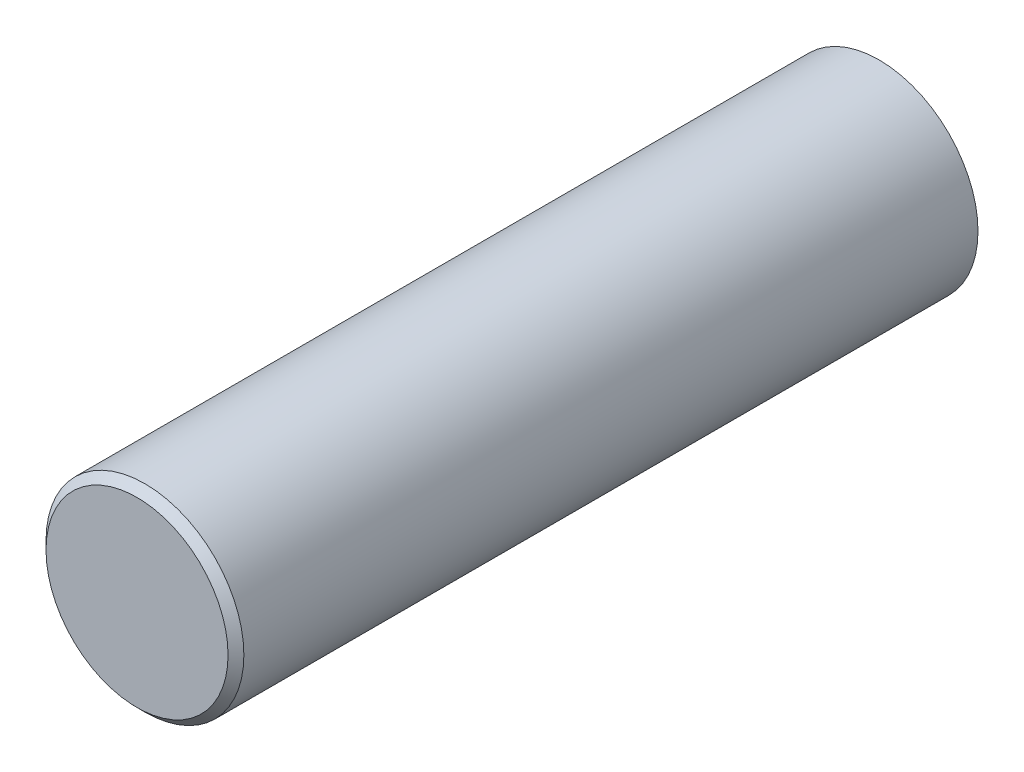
from build123d import *

# Parameters (mm, degrees)
ESQUISSE1_R      = 10
EXTRUSION1_DEPTH = 75
CHANFREIN1_SIZE  = 0.8


with BuildPart() as part:
    # Esquisse1 → Extrusion1 (new body)
    with BuildSketch(Plane.XY):
        Circle(ESQUISSE1_R)
    extrude(amount=EXTRUSION1_DEPTH)

    # Chanfrein1
    chanfrein1_edges = [part.edges().sort_by_distance(p)[0] for p in [
        (-10, 0, 75),
    ]]
    chamfer(chanfrein1_edges, length=CHANFREIN1_SIZE)


solid = part.part
